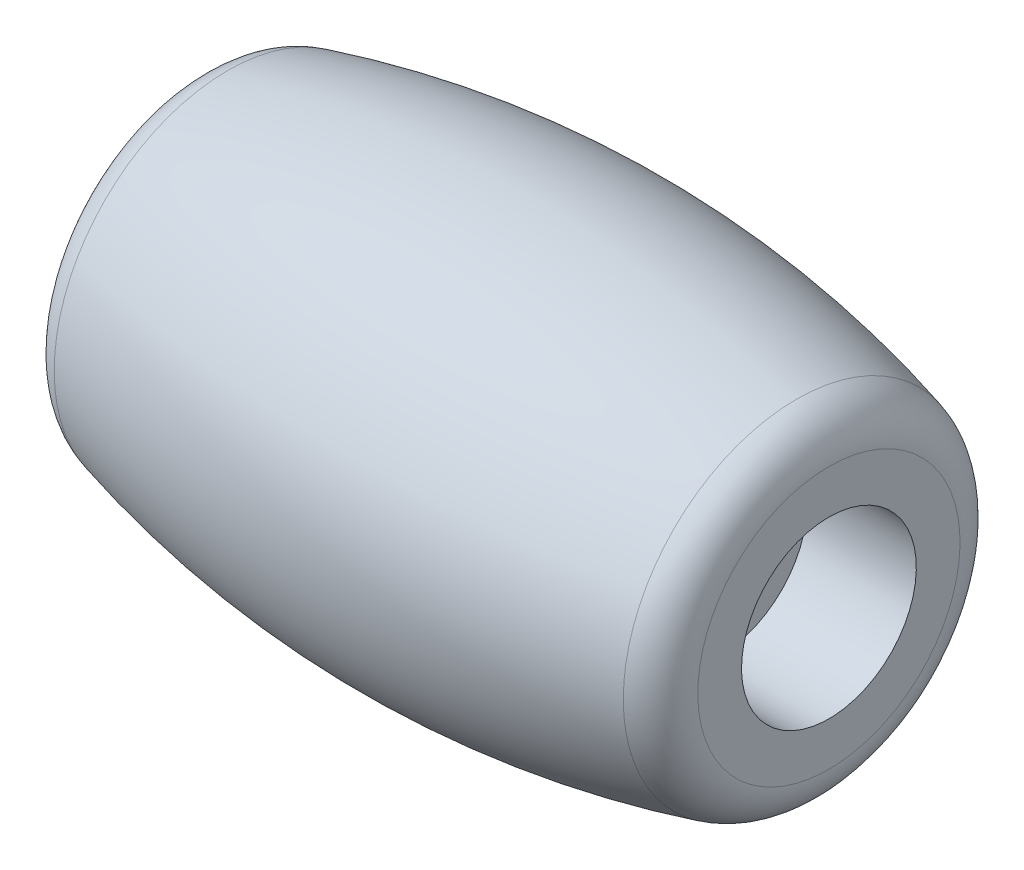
ISO-10303-21;
HEADER;
FILE_DESCRIPTION(('STEP AP214'),'2;1');
FILE_NAME('part.step','',(''),(''),'','','');
FILE_SCHEMA(('AUTOMOTIVE_DESIGN { 1 0 10303 214 1 1 1 1 }'));
ENDSEC;
DATA;
#1=APPLICATION_CONTEXT('core data for automotive mechanical design processes');
#2=APPLICATION_PROTOCOL_DEFINITION('international standard','automotive_design',2000,#1);
#3=PRODUCT_CONTEXT('',#1,'mechanical');
#4=PRODUCT('Part','Part','',(#3));
#5=PRODUCT_RELATED_PRODUCT_CATEGORY('part','',(#4));
#6=PRODUCT_DEFINITION_FORMATION('','',#4);
#7=PRODUCT_DEFINITION_CONTEXT('part definition',#1,'design');
#8=PRODUCT_DEFINITION('design','',#6,#7);
#9=PRODUCT_DEFINITION_SHAPE('','',#8);
#10=(LENGTH_UNIT() NAMED_UNIT(*) SI_UNIT(.MILLI.,.METRE.));
#11=(NAMED_UNIT(*) PLANE_ANGLE_UNIT() SI_UNIT($,.RADIAN.));
#12=(NAMED_UNIT(*) SI_UNIT($,.STERADIAN.) SOLID_ANGLE_UNIT());
#13=UNCERTAINTY_MEASURE_WITH_UNIT(LENGTH_MEASURE(1.E-05),#10,'distance_accuracy_value','');
#14=(GEOMETRIC_REPRESENTATION_CONTEXT(3) GLOBAL_UNCERTAINTY_ASSIGNED_CONTEXT((#13)) GLOBAL_UNIT_ASSIGNED_CONTEXT((#10,
#11,#12)) REPRESENTATION_CONTEXT('',''));
#15=CARTESIAN_POINT('',(0.,0.,0.));
#16=DIRECTION('',(0.,0.,1.));
#17=DIRECTION('',(1.,0.,0.));
#18=AXIS2_PLACEMENT_3D('',#15,#16,#17);
#19=CARTESIAN_POINT('',(-0.00125000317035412,-7.5,0.));
#20=DIRECTION('',(1.,0.,0.));
#21=DIRECTION('',(0.,1.,0.));
#22=AXIS2_PLACEMENT_3D('',#19,#20,#21);
#23=CYLINDRICAL_SURFACE('',#22,4.);
#24=CARTESIAN_POINT('',(5.,-7.5,0.));
#25=DIRECTION('',(1.,0.,0.));
#26=DIRECTION('',(0.,1.,0.));
#27=AXIS2_PLACEMENT_3D('',#24,#25,#26);
#28=CIRCLE('',#27,4.);
#29=CARTESIAN_POINT('',(5.,-3.5,0.));
#30=VERTEX_POINT('',#29);
#31=EDGE_CURVE('E10',#30,#30,#28,.T.);
#32=ORIENTED_EDGE('',*,*,#31,.T.);
#33=EDGE_LOOP('',(#32));
#34=FACE_BOUND('',#33,.T.);
#35=CARTESIAN_POINT('',(0.,-7.5,0.));
#36=DIRECTION('',(1.,0.,0.));
#37=DIRECTION('',(0.,1.,0.));
#38=AXIS2_PLACEMENT_3D('',#35,#36,#37);
#39=CIRCLE('',#38,3.99999999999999);
#40=CARTESIAN_POINT('',(0.,-3.5,0.));
#41=VERTEX_POINT('',#40);
#42=EDGE_CURVE('E80',#41,#41,#39,.T.);
#43=ORIENTED_EDGE('',*,*,#42,.F.);
#44=EDGE_LOOP('',(#43));
#45=FACE_BOUND('',#44,.T.);
#46=ADVANCED_FACE('F35',(#34,#45),#23,.F.);
#47=CARTESIAN_POINT('',(5.,-3.5,0.));
#48=DIRECTION('',(-1.,0.,0.));
#49=DIRECTION('',(0.,-1.,0.));
#50=AXIS2_PLACEMENT_3D('',#47,#48,#49);
#51=PLANE('',#50);
#52=CARTESIAN_POINT('',(5.,-7.5,0.));
#53=DIRECTION('',(1.,0.,0.));
#54=DIRECTION('',(0.,1.,0.));
#55=AXIS2_PLACEMENT_3D('',#52,#53,#54);
#56=CIRCLE('',#55,2.5);
#57=CARTESIAN_POINT('',(5.,-5.,0.));
#58=VERTEX_POINT('',#57);
#59=EDGE_CURVE('E42',#58,#58,#56,.T.);
#60=ORIENTED_EDGE('',*,*,#59,.T.);
#61=EDGE_LOOP('',(#60));
#62=FACE_BOUND('',#61,.T.);
#63=ORIENTED_EDGE('',*,*,#31,.F.);
#64=EDGE_LOOP('',(#63));
#65=FACE_BOUND('',#64,.T.);
#66=ADVANCED_FACE('F90',(#62,#65),#51,.T.);
#67=CARTESIAN_POINT('',(-0.00125000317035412,-7.5,0.));
#68=DIRECTION('',(1.,0.,0.));
#69=DIRECTION('',(0.,1.,0.));
#70=AXIS2_PLACEMENT_3D('',#67,#68,#69);
#71=CYLINDRICAL_SURFACE('',#70,2.5);
#72=CARTESIAN_POINT('',(24.,-7.5,0.));
#73=DIRECTION('',(1.,0.,0.));
#74=DIRECTION('',(0.,1.,0.));
#75=AXIS2_PLACEMENT_3D('',#72,#73,#74);
#76=CIRCLE('',#75,2.5);
#77=CARTESIAN_POINT('',(24.,-5.,0.));
#78=VERTEX_POINT('',#77);
#79=EDGE_CURVE('E48',#78,#78,#76,.T.);
#80=ORIENTED_EDGE('',*,*,#79,.T.);
#81=EDGE_LOOP('',(#80));
#82=FACE_BOUND('',#81,.T.);
#83=ORIENTED_EDGE('',*,*,#59,.F.);
#84=EDGE_LOOP('',(#83));
#85=FACE_BOUND('',#84,.T.);
#86=ADVANCED_FACE('F94',(#82,#85),#71,.F.);
#87=CARTESIAN_POINT('',(24.,-5.,0.));
#88=DIRECTION('',(1.,0.,0.));
#89=DIRECTION('',(0.,1.,0.));
#90=AXIS2_PLACEMENT_3D('',#87,#88,#89);
#91=PLANE('',#90);
#92=CARTESIAN_POINT('',(24.,-7.5,0.));
#93=DIRECTION('',(1.,0.,0.));
#94=DIRECTION('',(0.,1.,0.));
#95=AXIS2_PLACEMENT_3D('',#92,#93,#94);
#96=CIRCLE('',#95,4.);
#97=CARTESIAN_POINT('',(24.,-3.5,0.));
#98=VERTEX_POINT('',#97);
#99=EDGE_CURVE('E54',#98,#98,#96,.T.);
#100=ORIENTED_EDGE('',*,*,#99,.T.);
#101=EDGE_LOOP('',(#100));
#102=FACE_BOUND('',#101,.T.);
#103=ORIENTED_EDGE('',*,*,#79,.F.);
#104=EDGE_LOOP('',(#103));
#105=FACE_BOUND('',#104,.T.);
#106=ADVANCED_FACE('F98',(#102,#105),#91,.T.);
#107=CARTESIAN_POINT('',(-0.00125000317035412,-7.5,0.));
#108=DIRECTION('',(1.,0.,0.));
#109=DIRECTION('',(0.,1.,0.));
#110=AXIS2_PLACEMENT_3D('',#107,#108,#109);
#111=CYLINDRICAL_SURFACE('',#110,4.);
#112=CARTESIAN_POINT('',(29.,-7.5,0.));
#113=DIRECTION('',(1.,0.,0.));
#114=DIRECTION('',(0.,1.,0.));
#115=AXIS2_PLACEMENT_3D('',#112,#113,#114);
#116=CIRCLE('',#115,4.);
#117=CARTESIAN_POINT('',(29.,-3.5,0.));
#118=VERTEX_POINT('',#117);
#119=EDGE_CURVE('E60',#118,#118,#116,.T.);
#120=ORIENTED_EDGE('',*,*,#119,.T.);
#121=EDGE_LOOP('',(#120));
#122=FACE_BOUND('',#121,.T.);
#123=ORIENTED_EDGE('',*,*,#99,.F.);
#124=EDGE_LOOP('',(#123));
#125=FACE_BOUND('',#124,.T.);
#126=ADVANCED_FACE('F105',(#122,#125),#111,.F.);
#127=CARTESIAN_POINT('',(29.,-3.5,0.));
#128=DIRECTION('',(1.,0.,0.));
#129=DIRECTION('',(0.,1.,0.));
#130=AXIS2_PLACEMENT_3D('',#127,#128,#129);
#131=PLANE('',#130);
#132=CARTESIAN_POINT('',(29.,-7.5,0.));
#133=DIRECTION('',(1.,0.,0.));
#134=DIRECTION('',(0.,1.,0.));
#135=AXIS2_PLACEMENT_3D('',#132,#133,#134);
#136=CIRCLE('',#135,6.);
#137=CARTESIAN_POINT('',(29.,-1.5,0.));
#138=VERTEX_POINT('',#137);
#139=EDGE_CURVE('E64',#138,#138,#136,.T.);
#140=ORIENTED_EDGE('',*,*,#139,.T.);
#141=EDGE_LOOP('',(#140));
#142=FACE_BOUND('',#141,.T.);
#143=ORIENTED_EDGE('',*,*,#119,.F.);
#144=EDGE_LOOP('',(#143));
#145=FACE_BOUND('',#144,.T.);
#146=ADVANCED_FACE('F109',(#142,#145),#131,.T.);
#147=CARTESIAN_POINT('',(27.,-7.5,0.));
#148=DIRECTION('',(1.,0.,0.));
#149=DIRECTION('',(0.,1.,0.));
#150=AXIS2_PLACEMENT_3D('',#147,#148,#149);
#151=TOROIDAL_SURFACE('',#150,6.,1.99999999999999);
#152=CARTESIAN_POINT('',(27.5208333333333,-7.5,0.));
#153=DIRECTION('',(1.,0.,0.));
#154=DIRECTION('',(0.,1.,0.));
#155=AXIS2_PLACEMENT_3D('',#152,#153,#154);
#156=CIRCLE('',#155,7.93099265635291);
#157=CARTESIAN_POINT('',(27.5208333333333,0.430992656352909,0.));
#158=VERTEX_POINT('',#157);
#159=EDGE_CURVE('E68',#158,#158,#156,.T.);
#160=ORIENTED_EDGE('',*,*,#159,.T.);
#161=EDGE_LOOP('',(#160));
#162=FACE_BOUND('',#161,.T.);
#163=ORIENTED_EDGE('',*,*,#139,.F.);
#164=EDGE_LOOP('',(#163));
#165=FACE_BOUND('',#164,.T.);
#166=ADVANCED_FACE('F113',(#162,#165),#151,.T.);
#167=CARTESIAN_POINT('',(14.5,-7.49999999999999,0.));
#168=DIRECTION('',(1.,0.,0.));
#169=DIRECTION('',(0.,1.,0.));
#170=AXIS2_PLACEMENT_3D('',#167,#168,#169);
#171=DEGENERATE_TOROIDAL_SURFACE('',#170,40.34382375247,50.,.F.);
#172=CARTESIAN_POINT('',(1.47916666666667,-7.5,0.));
#173=DIRECTION('',(1.,0.,0.));
#174=DIRECTION('',(0.,1.,0.));
#175=AXIS2_PLACEMENT_3D('',#172,#173,#174);
#176=CIRCLE('',#175,7.9309926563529);
#177=CARTESIAN_POINT('',(1.47916666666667,0.430992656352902,0.));
#178=VERTEX_POINT('',#177);
#179=EDGE_CURVE('E72',#178,#178,#176,.T.);
#180=ORIENTED_EDGE('',*,*,#179,.T.);
#181=EDGE_LOOP('',(#180));
#182=FACE_BOUND('',#181,.T.);
#183=ORIENTED_EDGE('',*,*,#159,.F.);
#184=EDGE_LOOP('',(#183));
#185=FACE_BOUND('',#184,.T.);
#186=ADVANCED_FACE('F117',(#182,#185),#171,.F.);
#187=CARTESIAN_POINT('',(2.,-7.5,0.));
#188=DIRECTION('',(1.,0.,0.));
#189=DIRECTION('',(0.,1.,0.));
#190=AXIS2_PLACEMENT_3D('',#187,#188,#189);
#191=TOROIDAL_SURFACE('',#190,5.99999999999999,2.);
#192=CARTESIAN_POINT('',(0.,-7.5,0.));
#193=DIRECTION('',(1.,0.,0.));
#194=DIRECTION('',(0.,1.,0.));
#195=AXIS2_PLACEMENT_3D('',#192,#193,#194);
#196=CIRCLE('',#195,5.99999999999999);
#197=CARTESIAN_POINT('',(0.,-1.5,0.));
#198=VERTEX_POINT('',#197);
#199=EDGE_CURVE('E76',#198,#198,#196,.T.);
#200=ORIENTED_EDGE('',*,*,#199,.T.);
#201=EDGE_LOOP('',(#200));
#202=FACE_BOUND('',#201,.T.);
#203=ORIENTED_EDGE('',*,*,#179,.F.);
#204=EDGE_LOOP('',(#203));
#205=FACE_BOUND('',#204,.T.);
#206=ADVANCED_FACE('F121',(#202,#205),#191,.T.);
#207=CARTESIAN_POINT('',(0.,-1.5,0.));
#208=DIRECTION('',(-1.,0.,0.));
#209=DIRECTION('',(0.,-1.,0.));
#210=AXIS2_PLACEMENT_3D('',#207,#208,#209);
#211=PLANE('',#210);
#212=ORIENTED_EDGE('',*,*,#42,.T.);
#213=EDGE_LOOP('',(#212));
#214=FACE_BOUND('',#213,.T.);
#215=ORIENTED_EDGE('',*,*,#199,.F.);
#216=EDGE_LOOP('',(#215));
#217=FACE_BOUND('',#216,.T.);
#218=ADVANCED_FACE('F86',(#214,#217),#211,.T.);
#219=CLOSED_SHELL('',(#46,#66,#86,#106,#126,#146,#166,#186,#206,#218));
#220=MANIFOLD_SOLID_BREP('B2',#219);
#221=ADVANCED_BREP_SHAPE_REPRESENTATION('',(#18,#220),#14);
#222=SHAPE_DEFINITION_REPRESENTATION(#9,#221);
ENDSEC;
END-ISO-10303-21;
